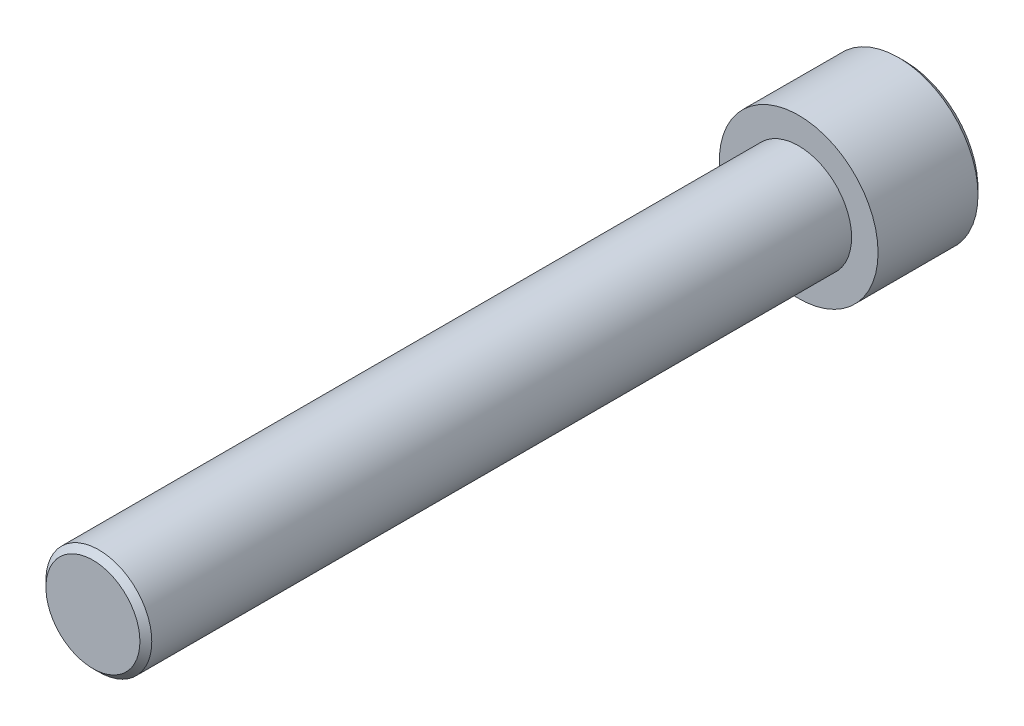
ISO-10303-21;
HEADER;
FILE_DESCRIPTION(('STEP AP214'),'2;1');
FILE_NAME('part.step','',(''),(''),'','','');
FILE_SCHEMA(('AUTOMOTIVE_DESIGN { 1 0 10303 214 1 1 1 1 }'));
ENDSEC;
DATA;
#1=APPLICATION_CONTEXT('core data for automotive mechanical design processes');
#2=APPLICATION_PROTOCOL_DEFINITION('international standard','automotive_design',2000,#1);
#3=PRODUCT_CONTEXT('',#1,'mechanical');
#4=PRODUCT('Part','Part','',(#3));
#5=PRODUCT_RELATED_PRODUCT_CATEGORY('part','',(#4));
#6=PRODUCT_DEFINITION_FORMATION('','',#4);
#7=PRODUCT_DEFINITION_CONTEXT('part definition',#1,'design');
#8=PRODUCT_DEFINITION('design','',#6,#7);
#9=PRODUCT_DEFINITION_SHAPE('','',#8);
#10=(LENGTH_UNIT() NAMED_UNIT(*) SI_UNIT(.MILLI.,.METRE.));
#11=(NAMED_UNIT(*) PLANE_ANGLE_UNIT() SI_UNIT($,.RADIAN.));
#12=(NAMED_UNIT(*) SI_UNIT($,.STERADIAN.) SOLID_ANGLE_UNIT());
#13=UNCERTAINTY_MEASURE_WITH_UNIT(LENGTH_MEASURE(1.E-05),#10,'distance_accuracy_value','');
#14=(GEOMETRIC_REPRESENTATION_CONTEXT(3) GLOBAL_UNCERTAINTY_ASSIGNED_CONTEXT((#13)) GLOBAL_UNIT_ASSIGNED_CONTEXT((#10,
#11,#12)) REPRESENTATION_CONTEXT('',''));
#15=CARTESIAN_POINT('',(0.,0.,0.));
#16=DIRECTION('',(0.,0.,1.));
#17=DIRECTION('',(1.,0.,0.));
#18=AXIS2_PLACEMENT_3D('',#15,#16,#17);
#19=CARTESIAN_POINT('',(0.,0.,63.5));
#20=DIRECTION('',(0.,0.,1.));
#21=DIRECTION('',(1.,0.,0.));
#22=AXIS2_PLACEMENT_3D('',#19,#20,#21);
#23=PLANE('',#22);
#24=CARTESIAN_POINT('',(0.,0.,63.5));
#25=DIRECTION('',(0.,0.,1.));
#26=DIRECTION('',(1.,0.,0.));
#27=AXIS2_PLACEMENT_3D('',#24,#25,#26);
#28=CIRCLE('',#27,4.2291);
#29=CARTESIAN_POINT('',(4.2291,0.,63.5));
#30=VERTEX_POINT('',#29);
#31=EDGE_CURVE('E40',#30,#30,#28,.T.);
#32=ORIENTED_EDGE('',*,*,#31,.T.);
#33=EDGE_LOOP('',(#32));
#34=FACE_BOUND('',#33,.T.);
#35=ADVANCED_FACE('F32',(#34),#23,.T.);
#36=CARTESIAN_POINT('',(7.14375,0.,-9.525));
#37=DIRECTION('',(0.,0.,-1.));
#38=DIRECTION('',(-1.,0.,0.));
#39=AXIS2_PLACEMENT_3D('',#36,#37,#38);
#40=PLANE('',#39);
#41=CARTESIAN_POINT('',(0.,0.,-9.525));
#42=DIRECTION('',(0.,0.,-1.));
#43=DIRECTION('',(-1.,0.,0.));
#44=AXIS2_PLACEMENT_3D('',#41,#42,#43);
#45=CIRCLE('',#44,6.61035000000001);
#46=CARTESIAN_POINT('',(-6.61035000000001,0.,-9.525));
#47=VERTEX_POINT('',#46);
#48=EDGE_CURVE('E148',#47,#47,#45,.T.);
#49=ORIENTED_EDGE('',*,*,#48,.T.);
#50=EDGE_LOOP('',(#49));
#51=FACE_BOUND('',#50,.T.);
#52=DIRECTION('',(0.00412520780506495,-0.999991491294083,0.));
#53=VECTOR('',#52,1.);
#54=CARTESIAN_POINT('',(3.95926389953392,2.30771130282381,-9.525));
#55=LINE('',#54,#53);
#56=CARTESIAN_POINT('',(3.95926389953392,2.30771130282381,-9.525));
#57=VERTEX_POINT('',#56);
#58=CARTESIAN_POINT('',(3.97816856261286,-2.27496746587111,-9.525));
#59=VERTEX_POINT('',#58);
#60=EDGE_CURVE('E47',#57,#59,#55,.T.);
#61=ORIENTED_EDGE('',*,*,#60,.F.);
#62=DIRECTION('',(0.868080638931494,-0.496423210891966,0.));
#63=VECTOR('',#62,1.);
#64=CARTESIAN_POINT('',(-0.0189046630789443,4.58267876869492,-9.525));
#65=LINE('',#64,#63);
#66=CARTESIAN_POINT('',(-0.0189046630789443,4.58267876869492,-9.525));
#67=VERTEX_POINT('',#66);
#68=EDGE_CURVE('E130',#67,#57,#65,.T.);
#69=ORIENTED_EDGE('',*,*,#68,.F.);
#70=DIRECTION('',(0.863955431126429,0.503568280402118,0.));
#71=VECTOR('',#70,1.);
#72=CARTESIAN_POINT('',(-3.97816856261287,2.27496746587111,-9.525));
#73=LINE('',#72,#71);
#74=CARTESIAN_POINT('',(-3.97816856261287,2.27496746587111,-9.525));
#75=VERTEX_POINT('',#74);
#76=EDGE_CURVE('E128',#75,#67,#73,.T.);
#77=ORIENTED_EDGE('',*,*,#76,.F.);
#78=DIRECTION('',(-0.00412520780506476,0.999991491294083,0.));
#79=VECTOR('',#78,1.);
#80=CARTESIAN_POINT('',(-3.95926389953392,-2.30771130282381,-9.525));
#81=LINE('',#80,#79);
#82=CARTESIAN_POINT('',(-3.95926389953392,-2.30771130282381,-9.525));
#83=VERTEX_POINT('',#82);
#84=EDGE_CURVE('E95',#83,#75,#81,.T.);
#85=ORIENTED_EDGE('',*,*,#84,.F.);
#86=DIRECTION('',(-0.868080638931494,0.496423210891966,0.));
#87=VECTOR('',#86,1.);
#88=CARTESIAN_POINT('',(0.0189046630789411,-4.58267876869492,-9.525));
#89=LINE('',#88,#87);
#90=CARTESIAN_POINT('',(0.0189046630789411,-4.58267876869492,-9.525));
#91=VERTEX_POINT('',#90);
#92=EDGE_CURVE('E124',#91,#83,#89,.T.);
#93=ORIENTED_EDGE('',*,*,#92,.F.);
#94=DIRECTION('',(-0.863955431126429,-0.503568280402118,0.));
#95=VECTOR('',#94,1.);
#96=CARTESIAN_POINT('',(3.97816856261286,-2.27496746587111,-9.525));
#97=LINE('',#96,#95);
#98=EDGE_CURVE('E121',#59,#91,#97,.T.);
#99=ORIENTED_EDGE('',*,*,#98,.F.);
#100=EDGE_LOOP('',(#61,#69,#77,#85,#93,#99));
#101=FACE_BOUND('',#100,.T.);
#102=ADVANCED_FACE('F163',(#51,#101),#40,.T.);
#103=CARTESIAN_POINT('',(0.,0.,63.5));
#104=DIRECTION('',(0.,0.,1.));
#105=DIRECTION('',(1.,0.,0.));
#106=AXIS2_PLACEMENT_3D('',#103,#104,#105);
#107=CYLINDRICAL_SURFACE('',#106,7.14375);
#108=CARTESIAN_POINT('',(0.,0.,-8.9916));
#109=DIRECTION('',(0.,0.,-1.));
#110=DIRECTION('',(-1.,0.,0.));
#111=AXIS2_PLACEMENT_3D('',#108,#109,#110);
#112=CIRCLE('',#111,7.14375);
#113=CARTESIAN_POINT('',(-7.14375,0.,-8.9916));
#114=VERTEX_POINT('',#113);
#115=EDGE_CURVE('E145',#114,#114,#112,.F.);
#116=ORIENTED_EDGE('',*,*,#115,.T.);
#117=EDGE_LOOP('',(#116));
#118=FACE_BOUND('',#117,.T.);
#119=CARTESIAN_POINT('',(0.,0.,0.));
#120=DIRECTION('',(0.,0.,1.));
#121=DIRECTION('',(1.,0.,0.));
#122=AXIS2_PLACEMENT_3D('',#119,#120,#121);
#123=CIRCLE('',#122,7.14375);
#124=CARTESIAN_POINT('',(7.14375,0.,0.));
#125=VERTEX_POINT('',#124);
#126=EDGE_CURVE('E142',#125,#125,#123,.T.);
#127=ORIENTED_EDGE('',*,*,#126,.F.);
#128=EDGE_LOOP('',(#127));
#129=FACE_BOUND('',#128,.T.);
#130=ADVANCED_FACE('F168',(#118,#129),#107,.T.);
#131=CARTESIAN_POINT('',(4.7625,0.,0.));
#132=DIRECTION('',(0.,0.,1.));
#133=DIRECTION('',(1.,0.,0.));
#134=AXIS2_PLACEMENT_3D('',#131,#132,#133);
#135=PLANE('',#134);
#136=ORIENTED_EDGE('',*,*,#126,.T.);
#137=EDGE_LOOP('',(#136));
#138=FACE_BOUND('',#137,.T.);
#139=CARTESIAN_POINT('',(0.,0.,0.));
#140=DIRECTION('',(0.,0.,1.));
#141=DIRECTION('',(1.,0.,0.));
#142=AXIS2_PLACEMENT_3D('',#139,#140,#141);
#143=CIRCLE('',#142,4.7625);
#144=CARTESIAN_POINT('',(4.7625,0.,0.));
#145=VERTEX_POINT('',#144);
#146=EDGE_CURVE('E134',#145,#145,#143,.T.);
#147=ORIENTED_EDGE('',*,*,#146,.F.);
#148=EDGE_LOOP('',(#147));
#149=FACE_BOUND('',#148,.T.);
#150=ADVANCED_FACE('F174',(#138,#149),#135,.T.);
#151=CARTESIAN_POINT('',(0.,0.,63.5));
#152=DIRECTION('',(0.,0.,1.));
#153=DIRECTION('',(1.,0.,0.));
#154=AXIS2_PLACEMENT_3D('',#151,#152,#153);
#155=CYLINDRICAL_SURFACE('',#154,4.7625);
#156=CARTESIAN_POINT('',(0.,0.,62.9666));
#157=DIRECTION('',(0.,0.,1.));
#158=DIRECTION('',(1.,0.,0.));
#159=AXIS2_PLACEMENT_3D('',#156,#157,#158);
#160=CIRCLE('',#159,4.7625);
#161=CARTESIAN_POINT('',(4.7625,0.,62.9666));
#162=VERTEX_POINT('',#161);
#163=EDGE_CURVE('E11',#162,#162,#160,.F.);
#164=ORIENTED_EDGE('',*,*,#163,.T.);
#165=EDGE_LOOP('',(#164));
#166=FACE_BOUND('',#165,.T.);
#167=ORIENTED_EDGE('',*,*,#146,.T.);
#168=EDGE_LOOP('',(#167));
#169=FACE_BOUND('',#168,.T.);
#170=ADVANCED_FACE('F178',(#166,#169),#155,.T.);
#171=CARTESIAN_POINT('',(3.95926389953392,2.30771130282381,-3.175));
#172=DIRECTION('',(0.999991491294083,0.00412520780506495,0.));
#173=DIRECTION('',(-0.00412520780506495,0.999991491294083,0.));
#174=AXIS2_PLACEMENT_3D('',#171,#172,#173);
#175=PLANE('',#174);
#176=ORIENTED_EDGE('',*,*,#60,.T.);
#177=DIRECTION('',(0.,0.,-1.));
#178=VECTOR('',#177,1.);
#179=CARTESIAN_POINT('',(3.97816856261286,-2.27496746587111,-3.175));
#180=LINE('',#179,#178);
#181=CARTESIAN_POINT('',(3.97816856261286,-2.27496746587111,-3.175));
#182=VERTEX_POINT('',#181);
#183=EDGE_CURVE('E77',#182,#59,#180,.T.);
#184=ORIENTED_EDGE('',*,*,#183,.F.);
#185=DIRECTION('',(0.00412520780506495,-0.999991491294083,0.));
#186=VECTOR('',#185,1.);
#187=CARTESIAN_POINT('',(3.95926389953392,2.30771130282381,-3.175));
#188=LINE('',#187,#186);
#189=CARTESIAN_POINT('',(3.95926389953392,2.30771130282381,-3.175));
#190=VERTEX_POINT('',#189);
#191=EDGE_CURVE('E132',#190,#182,#188,.T.);
#192=ORIENTED_EDGE('',*,*,#191,.F.);
#193=DIRECTION('',(0.,0.,-1.));
#194=VECTOR('',#193,1.);
#195=CARTESIAN_POINT('',(3.95926389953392,2.30771130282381,-3.175));
#196=LINE('',#195,#194);
#197=EDGE_CURVE('E55',#190,#57,#196,.T.);
#198=ORIENTED_EDGE('',*,*,#197,.T.);
#199=EDGE_LOOP('',(#176,#184,#192,#198));
#200=FACE_BOUND('',#199,.T.);
#201=ADVANCED_FACE('F182',(#200),#175,.F.);
#202=CARTESIAN_POINT('',(-0.0189046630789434,4.58267876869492,-3.175));
#203=DIRECTION('',(0.496423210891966,0.868080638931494,0.));
#204=DIRECTION('',(-0.868080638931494,0.496423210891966,0.));
#205=AXIS2_PLACEMENT_3D('',#202,#203,#204);
#206=PLANE('',#205);
#207=ORIENTED_EDGE('',*,*,#68,.T.);
#208=ORIENTED_EDGE('',*,*,#197,.F.);
#209=DIRECTION('',(0.868080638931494,-0.496423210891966,0.));
#210=VECTOR('',#209,1.);
#211=CARTESIAN_POINT('',(-0.0189046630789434,4.58267876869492,-3.175));
#212=LINE('',#211,#210);
#213=CARTESIAN_POINT('',(-0.0189046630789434,4.58267876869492,-3.175));
#214=VERTEX_POINT('',#213);
#215=EDGE_CURVE('E107',#214,#190,#212,.T.);
#216=ORIENTED_EDGE('',*,*,#215,.F.);
#217=DIRECTION('',(0.,0.,-1.));
#218=VECTOR('',#217,1.);
#219=CARTESIAN_POINT('',(-0.0189046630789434,4.58267876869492,-3.175));
#220=LINE('',#219,#218);
#221=EDGE_CURVE('E99',#214,#67,#220,.T.);
#222=ORIENTED_EDGE('',*,*,#221,.T.);
#223=EDGE_LOOP('',(#207,#208,#216,#222));
#224=FACE_BOUND('',#223,.T.);
#225=ADVANCED_FACE('F186',(#224),#206,.F.);
#226=CARTESIAN_POINT('',(-3.97816856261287,2.27496746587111,-3.175));
#227=DIRECTION('',(-0.503568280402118,0.863955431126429,0.));
#228=DIRECTION('',(-0.863955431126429,-0.503568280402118,0.));
#229=AXIS2_PLACEMENT_3D('',#226,#227,#228);
#230=PLANE('',#229);
#231=ORIENTED_EDGE('',*,*,#76,.T.);
#232=ORIENTED_EDGE('',*,*,#221,.F.);
#233=DIRECTION('',(0.863955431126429,0.503568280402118,0.));
#234=VECTOR('',#233,1.);
#235=CARTESIAN_POINT('',(-3.97816856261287,2.27496746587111,-3.175));
#236=LINE('',#235,#234);
#237=CARTESIAN_POINT('',(-3.97816856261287,2.27496746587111,-3.175));
#238=VERTEX_POINT('',#237);
#239=EDGE_CURVE('E103',#238,#214,#236,.T.);
#240=ORIENTED_EDGE('',*,*,#239,.F.);
#241=DIRECTION('',(0.,0.,-1.));
#242=VECTOR('',#241,1.);
#243=CARTESIAN_POINT('',(-3.97816856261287,2.27496746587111,-3.175));
#244=LINE('',#243,#242);
#245=EDGE_CURVE('E88',#238,#75,#244,.T.);
#246=ORIENTED_EDGE('',*,*,#245,.T.);
#247=EDGE_LOOP('',(#231,#232,#240,#246));
#248=FACE_BOUND('',#247,.T.);
#249=ADVANCED_FACE('F104',(#248),#230,.F.);
#250=CARTESIAN_POINT('',(-3.95926389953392,-2.30771130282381,-3.175));
#251=DIRECTION('',(-0.999991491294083,-0.00412520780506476,0.));
#252=DIRECTION('',(0.00412520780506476,-0.999991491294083,0.));
#253=AXIS2_PLACEMENT_3D('',#250,#251,#252);
#254=PLANE('',#253);
#255=ORIENTED_EDGE('',*,*,#84,.T.);
#256=ORIENTED_EDGE('',*,*,#245,.F.);
#257=DIRECTION('',(-0.00412520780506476,0.999991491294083,0.));
#258=VECTOR('',#257,1.);
#259=CARTESIAN_POINT('',(-3.95926389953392,-2.30771130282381,-3.175));
#260=LINE('',#259,#258);
#261=CARTESIAN_POINT('',(-3.95926389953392,-2.30771130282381,-3.175));
#262=VERTEX_POINT('',#261);
#263=EDGE_CURVE('E92',#262,#238,#260,.T.);
#264=ORIENTED_EDGE('',*,*,#263,.F.);
#265=DIRECTION('',(0.,0.,-1.));
#266=VECTOR('',#265,1.);
#267=CARTESIAN_POINT('',(-3.95926389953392,-2.30771130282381,-3.175));
#268=LINE('',#267,#266);
#269=EDGE_CURVE('E100',#262,#83,#268,.T.);
#270=ORIENTED_EDGE('',*,*,#269,.T.);
#271=EDGE_LOOP('',(#255,#256,#264,#270));
#272=FACE_BOUND('',#271,.T.);
#273=ADVANCED_FACE('F90',(#272),#254,.F.);
#274=CARTESIAN_POINT('',(0.018904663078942,-4.58267876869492,-3.175));
#275=DIRECTION('',(-0.496423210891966,-0.868080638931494,0.));
#276=DIRECTION('',(0.868080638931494,-0.496423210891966,0.));
#277=AXIS2_PLACEMENT_3D('',#274,#275,#276);
#278=PLANE('',#277);
#279=ORIENTED_EDGE('',*,*,#92,.T.);
#280=ORIENTED_EDGE('',*,*,#269,.F.);
#281=DIRECTION('',(-0.868080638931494,0.496423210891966,0.));
#282=VECTOR('',#281,1.);
#283=CARTESIAN_POINT('',(0.018904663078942,-4.58267876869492,-3.175));
#284=LINE('',#283,#282);
#285=CARTESIAN_POINT('',(0.018904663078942,-4.58267876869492,-3.175));
#286=VERTEX_POINT('',#285);
#287=EDGE_CURVE('E113',#286,#262,#284,.T.);
#288=ORIENTED_EDGE('',*,*,#287,.F.);
#289=DIRECTION('',(0.,0.,-1.));
#290=VECTOR('',#289,1.);
#291=CARTESIAN_POINT('',(0.018904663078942,-4.58267876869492,-3.175));
#292=LINE('',#291,#290);
#293=EDGE_CURVE('E137',#286,#91,#292,.T.);
#294=ORIENTED_EDGE('',*,*,#293,.T.);
#295=EDGE_LOOP('',(#279,#280,#288,#294));
#296=FACE_BOUND('',#295,.T.);
#297=ADVANCED_FACE('F190',(#296),#278,.F.);
#298=CARTESIAN_POINT('',(3.97816856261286,-2.27496746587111,-3.175));
#299=DIRECTION('',(0.503568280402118,-0.863955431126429,0.));
#300=DIRECTION('',(0.863955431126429,0.503568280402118,0.));
#301=AXIS2_PLACEMENT_3D('',#298,#299,#300);
#302=PLANE('',#301);
#303=ORIENTED_EDGE('',*,*,#98,.T.);
#304=ORIENTED_EDGE('',*,*,#293,.F.);
#305=DIRECTION('',(-0.863955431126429,-0.503568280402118,0.));
#306=VECTOR('',#305,1.);
#307=CARTESIAN_POINT('',(3.97816856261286,-2.27496746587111,-3.175));
#308=LINE('',#307,#306);
#309=EDGE_CURVE('E115',#182,#286,#308,.T.);
#310=ORIENTED_EDGE('',*,*,#309,.F.);
#311=ORIENTED_EDGE('',*,*,#183,.T.);
#312=EDGE_LOOP('',(#303,#304,#310,#311));
#313=FACE_BOUND('',#312,.T.);
#314=ADVANCED_FACE('F187',(#313),#302,.F.);
#315=CARTESIAN_POINT('',(3.94035923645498,6.89039007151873,-3.175));
#316=DIRECTION('',(0.,0.,1.));
#317=DIRECTION('',(1.,0.,0.));
#318=AXIS2_PLACEMENT_3D('',#315,#316,#317);
#319=PLANE('',#318);
#320=ORIENTED_EDGE('',*,*,#191,.T.);
#321=ORIENTED_EDGE('',*,*,#309,.T.);
#322=ORIENTED_EDGE('',*,*,#287,.T.);
#323=ORIENTED_EDGE('',*,*,#263,.T.);
#324=ORIENTED_EDGE('',*,*,#239,.T.);
#325=ORIENTED_EDGE('',*,*,#215,.T.);
#326=EDGE_LOOP('',(#320,#321,#322,#323,#324,#325));
#327=FACE_BOUND('',#326,.T.);
#328=ADVANCED_FACE('F110',(#327),#319,.F.);
#329=CARTESIAN_POINT('',(0.,0.,-8.9916));
#330=DIRECTION('',(0.,0.,1.));
#331=DIRECTION('',(1.,0.,0.));
#332=AXIS2_PLACEMENT_3D('',#329,#330,#331);
#333=CONICAL_SURFACE('',#332,7.14375,0.785398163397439);
#334=ORIENTED_EDGE('',*,*,#48,.F.);
#335=EDGE_LOOP('',(#334));
#336=FACE_BOUND('',#335,.T.);
#337=ORIENTED_EDGE('',*,*,#115,.F.);
#338=EDGE_LOOP('',(#337));
#339=FACE_BOUND('',#338,.T.);
#340=ADVANCED_FACE('F155',(#336,#339),#333,.T.);
#341=CARTESIAN_POINT('',(0.,0.,63.5));
#342=DIRECTION('',(0.,0.,-1.));
#343=DIRECTION('',(-1.,0.,0.));
#344=AXIS2_PLACEMENT_3D('',#341,#342,#343);
#345=CONICAL_SURFACE('',#344,4.2291,0.785398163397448);
#346=ORIENTED_EDGE('',*,*,#163,.F.);
#347=EDGE_LOOP('',(#346));
#348=FACE_BOUND('',#347,.T.);
#349=ORIENTED_EDGE('',*,*,#31,.F.);
#350=EDGE_LOOP('',(#349));
#351=FACE_BOUND('',#350,.T.);
#352=ADVANCED_FACE('F34',(#348,#351),#345,.T.);
#353=CLOSED_SHELL('',(#35,#102,#130,#150,#170,#201,#225,#249,#273,#297,#314,#328,#340,#352));
#354=MANIFOLD_SOLID_BREP('B2',#353);
#355=ADVANCED_BREP_SHAPE_REPRESENTATION('',(#18,#354),#14);
#356=SHAPE_DEFINITION_REPRESENTATION(#9,#355);
ENDSEC;
END-ISO-10303-21;
